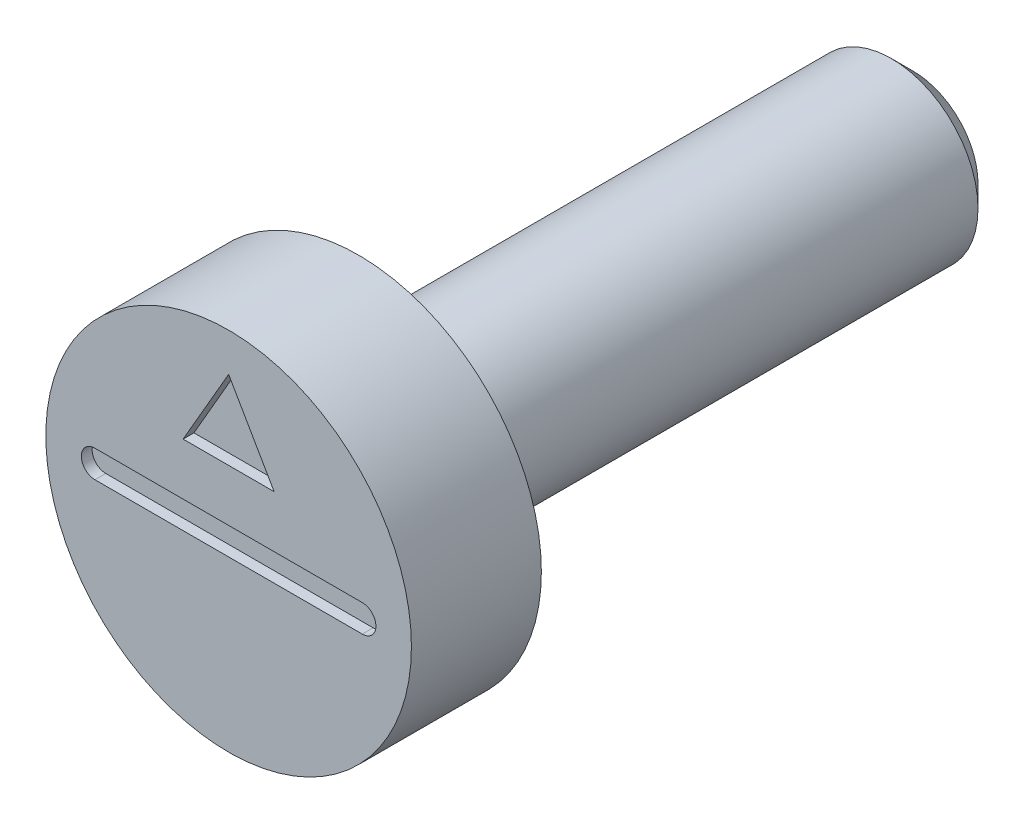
from build123d import *

# Parameters (mm, degrees)
CUT_EXTRUDE1_DEPTH = 0.25
CHAMFER1_SIZE      = 0.5


with BuildPart() as part:
    # Sketch4 → Revolve1 (revolve)
    with BuildSketch(Plane(origin=(0, 0, 0), x_dir=(0, 0, -1), z_dir=(1, 0, 0)), mode=Mode.PRIVATE) as revolve1_sk:
        Polygon((0, 0), (0, 4.22), (3, 4.22), (3, 2), (15.8, 2), (15.8, 0), align=None)
    revolve(revolve1_sk.sketch.rotate(Axis((0, 0, 3.747368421), (0, 0, -1)), 90), axis=Axis((0, 0, 3.747368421), (0, 0, -1)))

    # Sketch1 → Cut-Extrude1 (cut)
    with BuildSketch(Plane.XY):
        Polygon((0, 3.335), (-1.05077749, 1.515), (1.05077749, 1.515), align=None)
        with BuildLine():
            Line((-3.085, 0.315), (3.085, 0.315))
            ThreePointArc((3.085, 0.315), (3.4, 0), (3.085, -0.315))
            Line((3.085, -0.315), (-3.085, -0.315))
            ThreePointArc((-3.085, -0.315), (-3.4, 0), (-3.085, 0.315))
        make_face()
    extrude(amount=-CUT_EXTRUDE1_DEPTH, mode=Mode.SUBTRACT)

    # Chamfer1
    chamfer1_edges = [part.edges().sort_by_distance(p)[0] for p in [
        (-2, 0, -15.8),
    ]]
    chamfer(chamfer1_edges, length=CHAMFER1_SIZE)


solid = part.part
